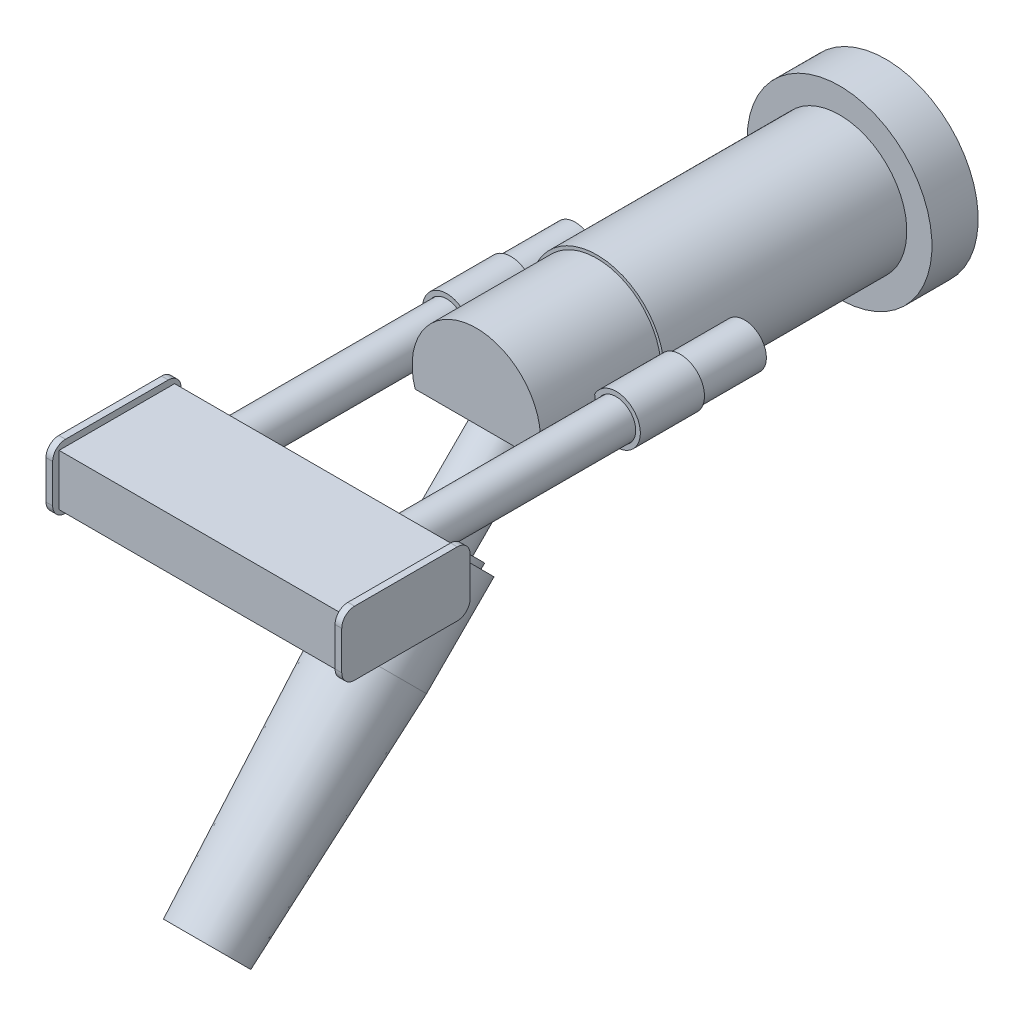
from build123d import *

# Parameters (mm, degrees)
SKETCH1_R          = 45.72
EXTRUDE1_DEPTH     = 22.86
SKETCH2_R          = 33.274
EXTRUDE2_DEPTH     = 120.015
SKETCH3_R          = 31.75
EXTRUDE3_DEPTH     = 59.6646
SKETCH4_R          = 28.0035
CUT_EXTRUDE1_DEPTH = 77.851
SKETCH6_R          = 10.795
EXTRUDE5_DEPTH     = 31.75
SKETCH10_R         = 11.938
SKETCH10_R_2       = 9.652
EXTRUDE9_DEPTH     = 31.75
SKETCH7_R          = 9.525
EXTRUDE6_DEPTH     = 138.43
SKETCH8_W          = 139.7
SKETCH8_H          = 25.4
EXTRUDE7_DEPTH     = 57.15
EXTRUDE8_DEPTH     = 3.302
CUT_EXTRUDE2_START = -30.27957
CUT_EXTRUDE2_DEPTH = 60.55914


with BuildPart() as part:
    # Sketch1 → Extrude1 (new body)
    with BuildSketch(Plane.XY):
        Circle(SKETCH1_R)
    extrude(amount=EXTRUDE1_DEPTH)

    # Sketch2 → Extrude2 (add)
    with BuildSketch(Plane.XY.offset(22.86)):
        Circle(SKETCH2_R)
    extrude(amount=EXTRUDE2_DEPTH)

    # Sketch4 → Cut-Extrude1 (cut)
    with BuildSketch(Plane(origin=(0, 0, 0), x_dir=(-1, 0, 0), z_dir=(0, 0, -1))):
        Circle(SKETCH4_R)
    extrude(amount=-CUT_EXTRUDE1_DEPTH, mode=Mode.SUBTRACT)


with BuildPart() as body_2:
    # Sketch3 → Extrude3 (new body)
    with BuildSketch(Plane.XY.offset(142.875)):
        Circle(SKETCH3_R)
    extrude(amount=EXTRUDE3_DEPTH)

    # Sketch11 → Cut-Extrude2 (cut)
    with BuildSketch(Plane(origin=(0, 0, 0), x_dir=(0, 0, -1), z_dir=(1, 0, 0)).offset(CUT_EXTRUDE2_START)):
        Polygon((-202.5396, -9.5504), (-180.34, -31.75), (-202.5396, -31.75), align=None)
    extrude(amount=CUT_EXTRUDE2_DEPTH, mode=Mode.SUBTRACT)


with BuildPart() as body_3:
    # Sketch6 → Extrude5 (new body)
    with BuildSketch(Plane.XY.offset(143.51)):
        with Locations((41.91, 0)):
            Circle(SKETCH6_R)
    extrude(amount=-EXTRUDE5_DEPTH)


with BuildPart() as body_4:
    # Sketch10 → Extrude9 (new body)
    with BuildSketch(Plane.XY.offset(143.51)):
        with Locations((41.91, 0)):
            Circle(SKETCH10_R)
        with Locations((41.91, 0)):
            Circle(SKETCH10_R_2, mode=Mode.SUBTRACT)
    extrude(amount=EXTRUDE9_DEPTH)


with BuildPart() as body_5:
    # Sketch7 → Extrude6 (new body)
    with BuildSketch(Plane.XY.offset(143.51)):
        with Locations((41.91, 0)):
            Circle(SKETCH7_R)
    extrude(amount=EXTRUDE6_DEPTH)


with BuildPart() as body_6:
    # Sketch8 → Extrude7 (new body)
    with BuildSketch(Plane.XY.offset(281.94)):
        Rectangle(SKETCH8_W, SKETCH8_H)
    extrude(amount=EXTRUDE7_DEPTH)


with BuildPart() as body_7:
    # Sketch9 → Extrude8 (new body)
    with BuildSketch(Plane(origin=(69.85, 0, 0), x_dir=(0, 0, -1), z_dir=(1, 0, 0))):
        with BuildLine():
            Line((-278.765, -9.525), (-278.765, 9.525))
            ThreePointArc((-278.765, 9.525), (-280.624871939, 14.015128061), (-285.115, 15.875))
            Line((-285.115, 15.875), (-335.915, 15.875))
            ThreePointArc((-335.915, 15.875), (-340.405128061, 14.015128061), (-342.265, 9.525))
            Line((-342.265, 9.525), (-342.265, -9.525))
            ThreePointArc((-342.265, -9.525), (-340.405128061, -14.015128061), (-335.915, -15.875))
            Line((-335.915, -15.875), (-285.115, -15.875))
            ThreePointArc((-285.115, -15.875), (-280.624871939, -14.015128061), (-278.765, -9.525))
        make_face()
    extrude(amount=EXTRUDE8_DEPTH)


with BuildPart() as body_8:
    # Mirror1: mirrored copy
    add(body_7.part.mirror(Plane(origin=(0, 0, 0), x_dir=(0, 0, 1), z_dir=(1, 0, 0))))


with BuildPart() as body_9:
    # Mirror1 2: mirrored copy
    add(body_5.part.mirror(Plane(origin=(0, 0, 0), x_dir=(0, 0, 1), z_dir=(1, 0, 0))))


with BuildPart() as body_10:
    # Mirror1 3: mirrored copy
    add(body_4.part.mirror(Plane(origin=(0, 0, 0), x_dir=(0, 0, 1), z_dir=(1, 0, 0))))


with BuildPart() as body_11:
    # Mirror1 4: mirrored copy
    add(body_3.part.mirror(Plane(origin=(0, 0, 0), x_dir=(0, 0, 1), z_dir=(1, 0, 0))))


with BuildPart() as body_12:
    # Sketch12 → Revolve1 (revolve)
    with BuildSketch(Plane(origin=(0, 0, 0), x_dir=(0, 0, -1), z_dir=(1, 0, 0)), mode=Mode.PRIVATE) as revolve1_sk:
        Polygon((-191.0588, -21.0312), (-199.94925356, -12.14074644), (-228.596270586, -40.787763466), (-232.008767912, -37.37526614), (-233.804819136, -39.171317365), (-237.513664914, -35.462471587), (-270.902817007, -68.851623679), (-348.19634405, -153.202706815), (-335.713325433, -165.685725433), align=None)
    revolve(revolve1_sk.sketch.rotate(Axis((0, -165.685725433, 335.713325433), (0, 0.7071067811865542, -0.7071067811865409)), 180), axis=Axis((0, -165.685725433, 335.713325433), (0, 0.7071067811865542, -0.7071067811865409)))


solid = Compound([part.part, body_2.part, body_3.part, body_4.part, body_5.part, body_6.part, body_7.part, body_8.part, body_9.part, body_10.part, body_11.part, body_12.part])
